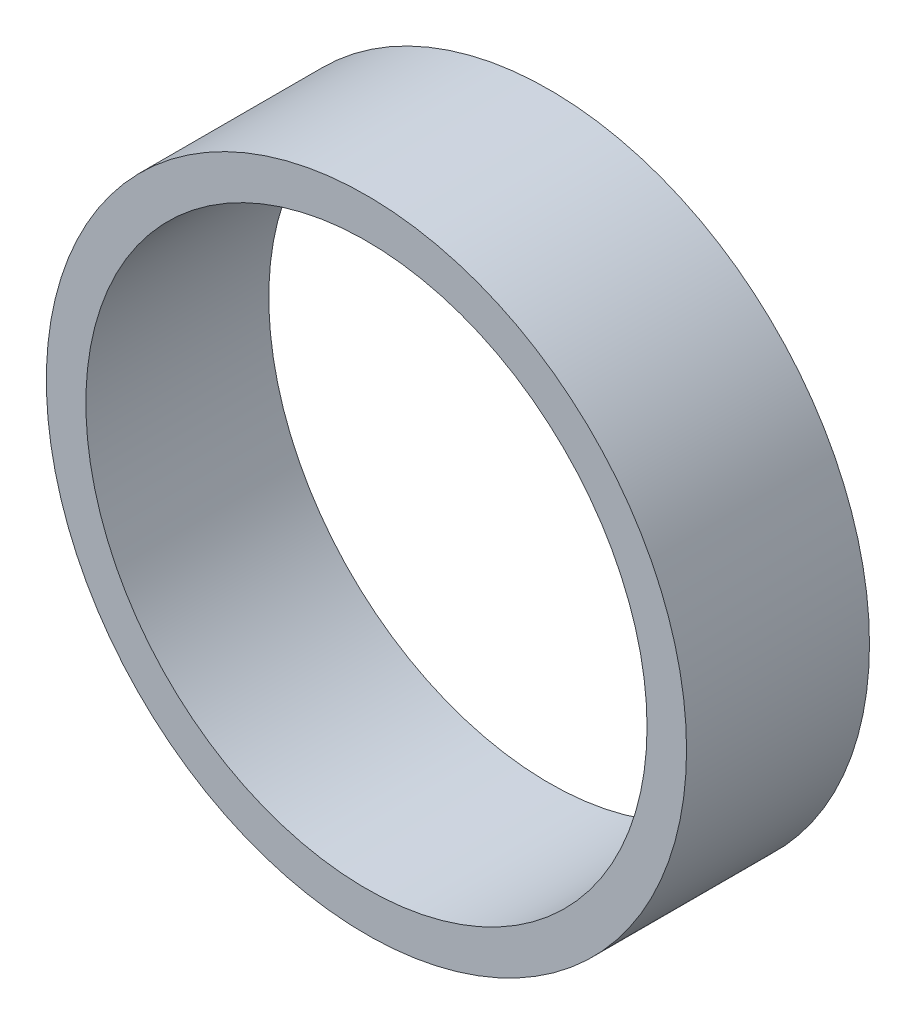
from build123d import *

# Parameters (mm, degrees)
SKETCH1_R      = 44.4499615
SKETCH1_R_2    = 38.963566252
BASEPIPE_DEPTH = 12.7


with BuildPart() as part:
    # Sketch1 → BasePipe (new, symmetric)
    with BuildSketch(Plane.XY):
        Circle(SKETCH1_R)
        Circle(SKETCH1_R_2, mode=Mode.SUBTRACT)
    extrude(amount=BASEPIPE_DEPTH, both=True)


solid = part.part
